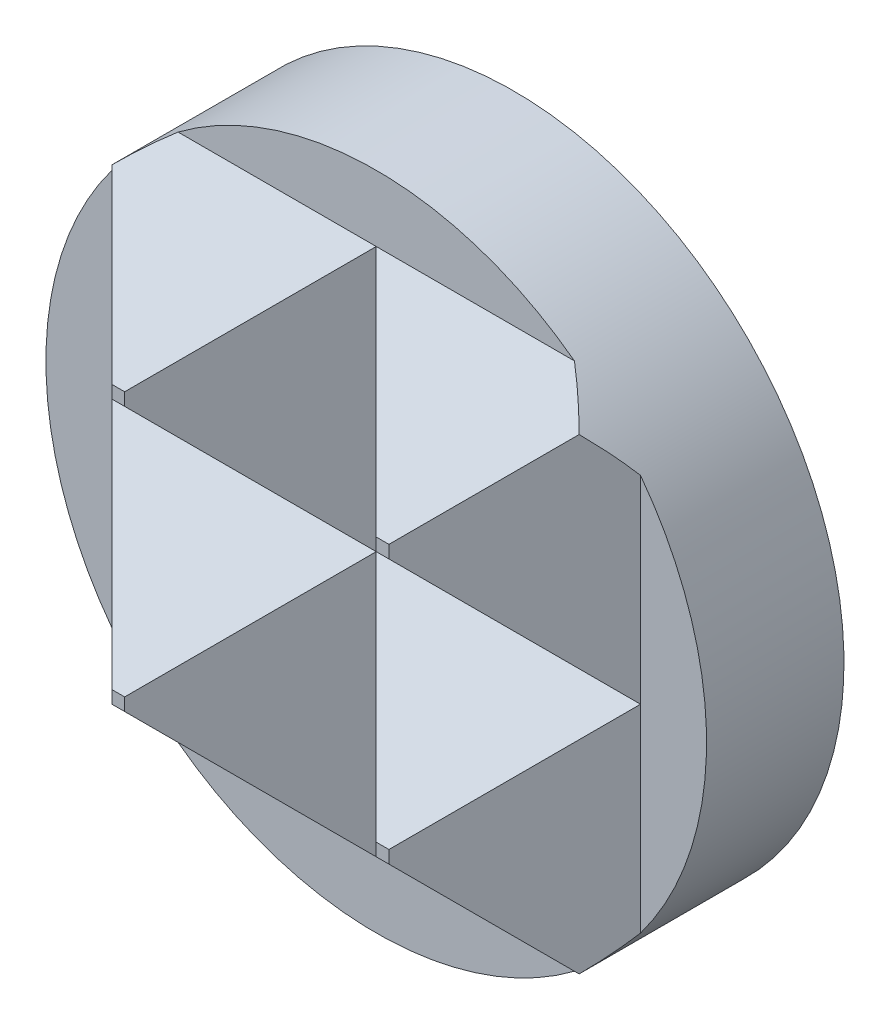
ISO-10303-21;
HEADER;
FILE_DESCRIPTION(('STEP AP214'),'2;1');
FILE_NAME('part.step','',(''),(''),'','','');
FILE_SCHEMA(('AUTOMOTIVE_DESIGN { 1 0 10303 214 1 1 1 1 }'));
ENDSEC;
DATA;
#1=APPLICATION_CONTEXT('core data for automotive mechanical design processes');
#2=APPLICATION_PROTOCOL_DEFINITION('international standard','automotive_design',2000,#1);
#3=PRODUCT_CONTEXT('',#1,'mechanical');
#4=PRODUCT('Part','Part','',(#3));
#5=PRODUCT_RELATED_PRODUCT_CATEGORY('part','',(#4));
#6=PRODUCT_DEFINITION_FORMATION('','',#4);
#7=PRODUCT_DEFINITION_CONTEXT('part definition',#1,'design');
#8=PRODUCT_DEFINITION('design','',#6,#7);
#9=PRODUCT_DEFINITION_SHAPE('','',#8);
#10=(LENGTH_UNIT() NAMED_UNIT(*) SI_UNIT(.MILLI.,.METRE.));
#11=(NAMED_UNIT(*) PLANE_ANGLE_UNIT() SI_UNIT($,.RADIAN.));
#12=(NAMED_UNIT(*) SI_UNIT($,.STERADIAN.) SOLID_ANGLE_UNIT());
#13=UNCERTAINTY_MEASURE_WITH_UNIT(LENGTH_MEASURE(1.E-05),#10,'distance_accuracy_value','');
#14=(GEOMETRIC_REPRESENTATION_CONTEXT(3) GLOBAL_UNCERTAINTY_ASSIGNED_CONTEXT((#13)) GLOBAL_UNIT_ASSIGNED_CONTEXT((#10,
#11,#12)) REPRESENTATION_CONTEXT('',''));
#15=CARTESIAN_POINT('',(0.,0.,0.));
#16=DIRECTION('',(0.,0.,1.));
#17=DIRECTION('',(1.,0.,0.));
#18=AXIS2_PLACEMENT_3D('',#15,#16,#17);
#19=CARTESIAN_POINT('',(3.96975,0.,2.159));
#20=DIRECTION('',(0.,0.707106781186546,-0.70710678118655));
#21=DIRECTION('',(0.,0.70710678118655,0.707106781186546));
#22=AXIS2_PLACEMENT_3D('',#19,#20,#21);
#23=PLANE('',#22);
#24=DIRECTION('',(-1.,0.,0.));
#25=VECTOR('',#24,1.);
#26=CARTESIAN_POINT('',(3.96975,0.,2.159));
#27=LINE('',#26,#25);
#28=CARTESIAN_POINT('',(3.175,0.,2.159));
#29=VERTEX_POINT('',#28);
#30=CARTESIAN_POINT('',(0.,0.,2.159));
#31=VERTEX_POINT('',#30);
#32=EDGE_CURVE('E18',#29,#31,#27,.T.);
#33=ORIENTED_EDGE('',*,*,#32,.F.);
#34=DIRECTION('',(-0.577350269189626,0.577350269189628,0.577350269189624));
#35=VECTOR('',#34,1.);
#36=CARTESIAN_POINT('',(3.43991666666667,-0.264916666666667,1.89408333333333));
#37=LINE('',#36,#35);
#38=CARTESIAN_POINT('',(1.6637,1.5113,3.6703));
#39=VERTEX_POINT('',#38);
#40=EDGE_CURVE('E308',#29,#39,#37,.T.);
#41=ORIENTED_EDGE('',*,*,#40,.T.);
#42=DIRECTION('',(-1.,0.,0.));
#43=VECTOR('',#42,1.);
#44=CARTESIAN_POINT('',(3.96975,1.5113,3.6703));
#45=LINE('',#44,#43);
#46=CARTESIAN_POINT('',(1.5113,1.5113,3.6703));
#47=VERTEX_POINT('',#46);
#48=EDGE_CURVE('E193',#39,#47,#45,.T.);
#49=ORIENTED_EDGE('',*,*,#48,.T.);
#50=DIRECTION('',(-0.577350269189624,-0.577350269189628,-0.577350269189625));
#51=VECTOR('',#50,1.);
#52=CARTESIAN_POINT('',(1.32325,1.32325,3.48225));
#53=LINE('',#52,#51);
#54=EDGE_CURVE('E272',#47,#31,#53,.T.);
#55=ORIENTED_EDGE('',*,*,#54,.T.);
#56=EDGE_LOOP('',(#33,#41,#49,#55));
#57=FACE_BOUND('',#56,.T.);
#58=ADVANCED_FACE('F14',(#57),#23,.F.);
#59=CARTESIAN_POINT('',(3.9698,0.,2.159));
#60=DIRECTION('',(0.,-0.707106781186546,-0.70710678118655));
#61=DIRECTION('',(0.,0.70710678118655,-0.707106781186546));
#62=AXIS2_PLACEMENT_3D('',#59,#60,#61);
#63=PLANE('',#62);
#64=DIRECTION('',(-1.,0.,0.));
#65=VECTOR('',#64,1.);
#66=CARTESIAN_POINT('',(3.9698,-1.5113,3.6703));
#67=LINE('',#66,#65);
#68=CARTESIAN_POINT('',(1.6637,-1.5113,3.6703));
#69=VERTEX_POINT('',#68);
#70=CARTESIAN_POINT('',(1.5113,-1.5113,3.6703));
#71=VERTEX_POINT('',#70);
#72=EDGE_CURVE('E181',#69,#71,#67,.T.);
#73=ORIENTED_EDGE('',*,*,#72,.F.);
#74=DIRECTION('',(0.577350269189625,0.577350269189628,-0.577350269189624));
#75=VECTOR('',#74,1.);
#76=CARTESIAN_POINT('',(3.43993333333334,0.264933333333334,1.89406666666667));
#77=LINE('',#76,#75);
#78=EDGE_CURVE('E304',#69,#29,#77,.T.);
#79=ORIENTED_EDGE('',*,*,#78,.T.);
#80=ORIENTED_EDGE('',*,*,#32,.T.);
#81=DIRECTION('',(0.577350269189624,-0.577350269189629,0.577350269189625));
#82=VECTOR('',#81,1.);
#83=CARTESIAN_POINT('',(1.32326666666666,-1.32326666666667,3.48226666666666));
#84=LINE('',#83,#82);
#85=EDGE_CURVE('E269',#31,#71,#84,.T.);
#86=ORIENTED_EDGE('',*,*,#85,.T.);
#87=EDGE_LOOP('',(#73,#79,#80,#86));
#88=FACE_BOUND('',#87,.T.);
#89=ADVANCED_FACE('F303',(#88),#63,.F.);
#90=CARTESIAN_POINT('',(3.96975,3.175,2.159));
#91=DIRECTION('',(0.,-0.707106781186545,-0.70710678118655));
#92=DIRECTION('',(0.,0.70710678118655,-0.707106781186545));
#93=AXIS2_PLACEMENT_3D('',#90,#91,#92);
#94=PLANE('',#93);
#95=DIRECTION('',(-1.,0.,0.));
#96=VECTOR('',#95,1.);
#97=CARTESIAN_POINT('',(3.96975,1.6637,3.6703));
#98=LINE('',#97,#96);
#99=CARTESIAN_POINT('',(1.6637,1.6637,3.6703));
#100=VERTEX_POINT('',#99);
#101=CARTESIAN_POINT('',(1.5113,1.6637,3.6703));
#102=VERTEX_POINT('',#101);
#103=EDGE_CURVE('E189',#100,#102,#98,.T.);
#104=ORIENTED_EDGE('',*,*,#103,.F.);
#105=DIRECTION('',(0.577350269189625,0.577350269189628,-0.577350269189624));
#106=VECTOR('',#105,1.);
#107=CARTESIAN_POINT('',(3.43991666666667,3.43991666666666,1.89408333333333));
#108=LINE('',#107,#106);
#109=CARTESIAN_POINT('',(2.80633003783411,2.80633003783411,2.52766996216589));
#110=VERTEX_POINT('',#109);
#111=EDGE_CURVE('E296',#100,#110,#108,.T.);
#112=ORIENTED_EDGE('',*,*,#111,.T.);
#113=CARTESIAN_POINT('',(0.,0.,5.334));
#114=DIRECTION('',(0.,-0.707106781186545,-0.70710678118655));
#115=DIRECTION('',(0.,-0.70710678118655,0.707106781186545));
#116=AXIS2_PLACEMENT_3D('',#113,#114,#115);
#117=ELLIPSE('',#116,5.6126600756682,3.96875);
#118=CARTESIAN_POINT('',(2.38125,3.175,2.159));
#119=VERTEX_POINT('',#118);
#120=EDGE_CURVE('E226',#119,#110,#117,.T.);
#121=ORIENTED_EDGE('',*,*,#120,.F.);
#122=DIRECTION('',(-1.,0.,0.));
#123=VECTOR('',#122,1.);
#124=CARTESIAN_POINT('',(3.96975,3.175,2.159));
#125=LINE('',#124,#123);
#126=CARTESIAN_POINT('',(0.,3.175,2.159));
#127=VERTEX_POINT('',#126);
#128=EDGE_CURVE('E197',#119,#127,#125,.T.);
#129=ORIENTED_EDGE('',*,*,#128,.T.);
#130=DIRECTION('',(0.577350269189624,-0.577350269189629,0.577350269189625));
#131=VECTOR('',#130,1.);
#132=CARTESIAN_POINT('',(1.32325,1.85175,3.48225));
#133=LINE('',#132,#131);
#134=EDGE_CURVE('E278',#127,#102,#133,.T.);
#135=ORIENTED_EDGE('',*,*,#134,.T.);
#136=EDGE_LOOP('',(#104,#112,#121,#129,#135));
#137=FACE_BOUND('',#136,.T.);
#138=ADVANCED_FACE('F280',(#137),#94,.F.);
#139=CARTESIAN_POINT('',(3.96975,1.6637,3.6703));
#140=DIRECTION('',(0.,0.,-1.));
#141=DIRECTION('',(-1.,0.,0.));
#142=AXIS2_PLACEMENT_3D('',#139,#140,#141);
#143=PLANE('',#142);
#144=ORIENTED_EDGE('',*,*,#48,.F.);
#145=DIRECTION('',(0.,1.,0.));
#146=VECTOR('',#145,1.);
#147=CARTESIAN_POINT('',(1.6637,1.6637,3.6703));
#148=LINE('',#147,#146);
#149=EDGE_CURVE('E326',#39,#100,#148,.T.);
#150=ORIENTED_EDGE('',*,*,#149,.T.);
#151=ORIENTED_EDGE('',*,*,#103,.T.);
#152=DIRECTION('',(0.,-1.,0.));
#153=VECTOR('',#152,1.);
#154=CARTESIAN_POINT('',(1.5113,1.6637,3.6703));
#155=LINE('',#154,#153);
#156=EDGE_CURVE('E275',#102,#47,#155,.T.);
#157=ORIENTED_EDGE('',*,*,#156,.T.);
#158=EDGE_LOOP('',(#144,#150,#151,#157));
#159=FACE_BOUND('',#158,.T.);
#160=ADVANCED_FACE('F344',(#159),#143,.F.);
#161=CARTESIAN_POINT('',(3.9698,-1.5113,3.6703));
#162=DIRECTION('',(0.,0.,-1.));
#163=DIRECTION('',(-1.,0.,0.));
#164=AXIS2_PLACEMENT_3D('',#161,#162,#163);
#165=PLANE('',#164);
#166=DIRECTION('',(-1.,0.,0.));
#167=VECTOR('',#166,1.);
#168=CARTESIAN_POINT('',(3.9698,-1.6637,3.6703));
#169=LINE('',#168,#167);
#170=CARTESIAN_POINT('',(1.6637,-1.6637,3.6703));
#171=VERTEX_POINT('',#170);
#172=CARTESIAN_POINT('',(1.5113,-1.6637,3.6703));
#173=VERTEX_POINT('',#172);
#174=EDGE_CURVE('E180',#171,#173,#169,.T.);
#175=ORIENTED_EDGE('',*,*,#174,.F.);
#176=DIRECTION('',(0.,1.,0.));
#177=VECTOR('',#176,1.);
#178=CARTESIAN_POINT('',(1.6637,-1.5113,3.6703));
#179=LINE('',#178,#177);
#180=EDGE_CURVE('E321',#171,#69,#179,.T.);
#181=ORIENTED_EDGE('',*,*,#180,.T.);
#182=ORIENTED_EDGE('',*,*,#72,.T.);
#183=DIRECTION('',(0.,-1.,0.));
#184=VECTOR('',#183,1.);
#185=CARTESIAN_POINT('',(1.5113,-1.5113,3.6703));
#186=LINE('',#185,#184);
#187=EDGE_CURVE('E266',#71,#173,#186,.T.);
#188=ORIENTED_EDGE('',*,*,#187,.T.);
#189=EDGE_LOOP('',(#175,#181,#182,#188));
#190=FACE_BOUND('',#189,.T.);
#191=ADVANCED_FACE('F346',(#190),#165,.F.);
#192=CARTESIAN_POINT('',(3.9698,-3.175,2.159));
#193=DIRECTION('',(0.,0.707106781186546,-0.70710678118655));
#194=DIRECTION('',(0.,0.70710678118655,0.707106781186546));
#195=AXIS2_PLACEMENT_3D('',#192,#193,#194);
#196=PLANE('',#195);
#197=CARTESIAN_POINT('',(0.,0.,5.334));
#198=DIRECTION('',(0.,0.707106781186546,-0.70710678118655));
#199=DIRECTION('',(0.,0.70710678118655,0.707106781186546));
#200=AXIS2_PLACEMENT_3D('',#197,#198,#199);
#201=ELLIPSE('',#200,5.61266007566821,3.96875);
#202=CARTESIAN_POINT('',(2.80633003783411,-2.80633003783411,2.52766996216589));
#203=VERTEX_POINT('',#202);
#204=CARTESIAN_POINT('',(2.38125,-3.175,2.159));
#205=VERTEX_POINT('',#204);
#206=EDGE_CURVE('E177',#203,#205,#201,.T.);
#207=ORIENTED_EDGE('',*,*,#206,.F.);
#208=DIRECTION('',(-0.577350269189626,0.577350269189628,0.577350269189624));
#209=VECTOR('',#208,1.);
#210=CARTESIAN_POINT('',(3.43993333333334,-3.43993333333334,1.89406666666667));
#211=LINE('',#210,#209);
#212=EDGE_CURVE('E289',#203,#171,#211,.T.);
#213=ORIENTED_EDGE('',*,*,#212,.T.);
#214=ORIENTED_EDGE('',*,*,#174,.T.);
#215=DIRECTION('',(-0.577350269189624,-0.577350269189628,-0.577350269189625));
#216=VECTOR('',#215,1.);
#217=CARTESIAN_POINT('',(1.32326666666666,-1.85173333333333,3.48226666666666));
#218=LINE('',#217,#216);
#219=CARTESIAN_POINT('',(0.,-3.175,2.159));
#220=VERTEX_POINT('',#219);
#221=EDGE_CURVE('E202',#173,#220,#218,.T.);
#222=ORIENTED_EDGE('',*,*,#221,.T.);
#223=DIRECTION('',(-1.,0.,0.));
#224=VECTOR('',#223,1.);
#225=CARTESIAN_POINT('',(3.9698,-3.175,2.159));
#226=LINE('',#225,#224);
#227=EDGE_CURVE('E186',#205,#220,#226,.T.);
#228=ORIENTED_EDGE('',*,*,#227,.F.);
#229=EDGE_LOOP('',(#207,#213,#214,#222,#228));
#230=FACE_BOUND('',#229,.T.);
#231=ADVANCED_FACE('F353',(#230),#196,.F.);
#232=CARTESIAN_POINT('',(-3.175,0.,2.159));
#233=VERTEX_POINT('',#232);
#234=EDGE_CURVE('E194',#31,#233,#27,.T.);
#235=ORIENTED_EDGE('',*,*,#234,.F.);
#236=DIRECTION('',(-0.577350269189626,0.577350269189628,0.577350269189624));
#237=VECTOR('',#236,1.);
#238=CARTESIAN_POINT('',(1.32325,-1.32325,0.83575));
#239=LINE('',#238,#237);
#240=CARTESIAN_POINT('',(-1.5113,1.5113,3.6703));
#241=VERTEX_POINT('',#240);
#242=EDGE_CURVE('E253',#31,#241,#239,.T.);
#243=ORIENTED_EDGE('',*,*,#242,.T.);
#244=CARTESIAN_POINT('',(-1.6637,1.5113,3.6703));
#245=VERTEX_POINT('',#244);
#246=EDGE_CURVE('E191',#241,#245,#45,.T.);
#247=ORIENTED_EDGE('',*,*,#246,.T.);
#248=DIRECTION('',(-0.577350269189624,-0.577350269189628,-0.577350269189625));
#249=VECTOR('',#248,1.);
#250=CARTESIAN_POINT('',(-0.793416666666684,2.38158333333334,4.54058333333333));
#251=LINE('',#250,#249);
#252=EDGE_CURVE('E159',#245,#233,#251,.T.);
#253=ORIENTED_EDGE('',*,*,#252,.T.);
#254=EDGE_LOOP('',(#235,#243,#247,#253));
#255=FACE_BOUND('',#254,.T.);
#256=ADVANCED_FACE('F250',(#255),#23,.F.);
#257=CARTESIAN_POINT('',(-1.5113,-1.5113,3.6703));
#258=VERTEX_POINT('',#257);
#259=CARTESIAN_POINT('',(-1.6637,-1.5113,3.6703));
#260=VERTEX_POINT('',#259);
#261=EDGE_CURVE('E165',#258,#260,#67,.T.);
#262=ORIENTED_EDGE('',*,*,#261,.F.);
#263=DIRECTION('',(0.577350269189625,0.577350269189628,-0.577350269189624));
#264=VECTOR('',#263,1.);
#265=CARTESIAN_POINT('',(1.32326666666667,1.32326666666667,0.835733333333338));
#266=LINE('',#265,#264);
#267=EDGE_CURVE('E257',#258,#31,#266,.T.);
#268=ORIENTED_EDGE('',*,*,#267,.T.);
#269=ORIENTED_EDGE('',*,*,#234,.T.);
#270=DIRECTION('',(0.577350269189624,-0.577350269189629,0.577350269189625));
#271=VECTOR('',#270,1.);
#272=CARTESIAN_POINT('',(-0.793400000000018,-2.3816,4.5406));
#273=LINE('',#272,#271);
#274=EDGE_CURVE('E148',#233,#260,#273,.T.);
#275=ORIENTED_EDGE('',*,*,#274,.T.);
#276=EDGE_LOOP('',(#262,#268,#269,#275));
#277=FACE_BOUND('',#276,.T.);
#278=ADVANCED_FACE('F312',(#277),#63,.F.);
#279=CARTESIAN_POINT('',(0.,0.,2.159));
#280=DIRECTION('',(0.,0.,1.));
#281=DIRECTION('',(1.,0.,0.));
#282=AXIS2_PLACEMENT_3D('',#279,#280,#281);
#283=PLANE('',#282);
#284=CARTESIAN_POINT('',(0.,0.,2.159));
#285=DIRECTION('',(0.,0.,1.));
#286=DIRECTION('',(1.,0.,0.));
#287=AXIS2_PLACEMENT_3D('',#284,#285,#286);
#288=CIRCLE('',#287,3.96875);
#289=CARTESIAN_POINT('',(-2.38125,-3.175,2.159));
#290=VERTEX_POINT('',#289);
#291=EDGE_CURVE('E220',#290,#205,#288,.T.);
#292=ORIENTED_EDGE('',*,*,#291,.T.);
#293=ORIENTED_EDGE('',*,*,#227,.T.);
#294=EDGE_CURVE('E183',#220,#290,#226,.T.);
#295=ORIENTED_EDGE('',*,*,#294,.T.);
#296=EDGE_LOOP('',(#292,#293,#295));
#297=FACE_BOUND('',#296,.T.);
#298=ADVANCED_FACE('F369',(#297),#283,.T.);
#299=CARTESIAN_POINT('',(0.,0.,0.));
#300=DIRECTION('',(0.,0.,1.));
#301=DIRECTION('',(1.,0.,0.));
#302=AXIS2_PLACEMENT_3D('',#299,#300,#301);
#303=CYLINDRICAL_SURFACE('',#302,3.96875);
#304=CARTESIAN_POINT('',(0.,0.,5.334));
#305=DIRECTION('',(0.707106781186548,0.,-0.707106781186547));
#306=DIRECTION('',(0.707106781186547,0.,0.707106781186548));
#307=AXIS2_PLACEMENT_3D('',#304,#305,#306);
#308=ELLIPSE('',#307,5.61266007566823,3.96875);
#309=CARTESIAN_POINT('',(-3.175,-2.38125,2.159));
#310=VERTEX_POINT('',#309);
#311=CARTESIAN_POINT('',(-2.80633003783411,-2.80633003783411,2.52766996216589));
#312=VERTEX_POINT('',#311);
#313=EDGE_CURVE('E39',#310,#312,#308,.F.);
#314=ORIENTED_EDGE('',*,*,#313,.F.);
#315=CARTESIAN_POINT('',(0.,0.,2.159));
#316=DIRECTION('',(0.,0.,-1.));
#317=DIRECTION('',(-1.,0.,0.));
#318=AXIS2_PLACEMENT_3D('',#315,#316,#317);
#319=CIRCLE('',#318,3.96875);
#320=CARTESIAN_POINT('',(-3.175,2.38125,2.159));
#321=VERTEX_POINT('',#320);
#322=EDGE_CURVE('E133',#321,#310,#319,.F.);
#323=ORIENTED_EDGE('',*,*,#322,.F.);
#324=CARTESIAN_POINT('',(-2.80633003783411,2.80633003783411,2.52766996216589));
#325=VERTEX_POINT('',#324);
#326=EDGE_CURVE('E158',#325,#321,#308,.F.);
#327=ORIENTED_EDGE('',*,*,#326,.F.);
#328=CARTESIAN_POINT('',(0.,0.,5.334));
#329=DIRECTION('',(0.,0.707106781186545,0.70710678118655));
#330=DIRECTION('',(0.,-0.70710678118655,0.707106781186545));
#331=AXIS2_PLACEMENT_3D('',#328,#329,#330);
#332=ELLIPSE('',#331,5.6126600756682,3.96875);
#333=CARTESIAN_POINT('',(-2.38125,3.175,2.159));
#334=VERTEX_POINT('',#333);
#335=EDGE_CURVE('E179',#334,#325,#332,.T.);
#336=ORIENTED_EDGE('',*,*,#335,.F.);
#337=EDGE_CURVE('E224',#119,#334,#288,.T.);
#338=ORIENTED_EDGE('',*,*,#337,.F.);
#339=ORIENTED_EDGE('',*,*,#120,.T.);
#340=CARTESIAN_POINT('',(0.,0.,5.334));
#341=DIRECTION('',(-0.707106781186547,0.,-0.707106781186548));
#342=DIRECTION('',(-0.707106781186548,0.,0.707106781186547));
#343=AXIS2_PLACEMENT_3D('',#340,#341,#342);
#344=ELLIPSE('',#343,5.61266007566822,3.96875);
#345=CARTESIAN_POINT('',(3.175,2.38125,2.159));
#346=VERTEX_POINT('',#345);
#347=EDGE_CURVE('E24',#346,#110,#344,.F.);
#348=ORIENTED_EDGE('',*,*,#347,.F.);
#349=CARTESIAN_POINT('',(0.,0.,2.159));
#350=DIRECTION('',(0.,0.,-1.));
#351=DIRECTION('',(-1.,0.,0.));
#352=AXIS2_PLACEMENT_3D('',#349,#350,#351);
#353=CIRCLE('',#352,3.96875);
#354=CARTESIAN_POINT('',(3.175,-2.38125,2.159));
#355=VERTEX_POINT('',#354);
#356=EDGE_CURVE('E142',#355,#346,#353,.F.);
#357=ORIENTED_EDGE('',*,*,#356,.F.);
#358=EDGE_CURVE('E9',#203,#355,#344,.F.);
#359=ORIENTED_EDGE('',*,*,#358,.F.);
#360=ORIENTED_EDGE('',*,*,#206,.T.);
#361=ORIENTED_EDGE('',*,*,#291,.F.);
#362=CARTESIAN_POINT('',(0.,0.,5.334));
#363=DIRECTION('',(0.,-0.707106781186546,0.70710678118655));
#364=DIRECTION('',(0.,0.70710678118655,0.707106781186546));
#365=AXIS2_PLACEMENT_3D('',#362,#363,#364);
#366=ELLIPSE('',#365,5.61266007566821,3.96875);
#367=EDGE_CURVE('E156',#312,#290,#366,.T.);
#368=ORIENTED_EDGE('',*,*,#367,.F.);
#369=EDGE_LOOP('',(#314,#323,#327,#336,#338,#339,#348,#357,#359,#360,#361,#368));
#370=FACE_BOUND('',#369,.T.);
#371=CARTESIAN_POINT('',(0.,0.,0.508));
#372=DIRECTION('',(0.,0.,-1.));
#373=DIRECTION('',(-1.,0.,0.));
#374=AXIS2_PLACEMENT_3D('',#371,#372,#373);
#375=CIRCLE('',#374,3.96875);
#376=CARTESIAN_POINT('',(-3.96875,0.,0.508));
#377=VERTEX_POINT('',#376);
#378=EDGE_CURVE('E225',#377,#377,#375,.T.);
#379=ORIENTED_EDGE('',*,*,#378,.F.);
#380=EDGE_LOOP('',(#379));
#381=FACE_BOUND('',#380,.T.);
#382=ADVANCED_FACE('F16',(#370,#381),#303,.T.);
#383=ORIENTED_EDGE('',*,*,#337,.T.);
#384=EDGE_CURVE('E231',#127,#334,#125,.T.);
#385=ORIENTED_EDGE('',*,*,#384,.F.);
#386=ORIENTED_EDGE('',*,*,#128,.F.);
#387=EDGE_LOOP('',(#383,#385,#386));
#388=FACE_BOUND('',#387,.T.);
#389=ADVANCED_FACE('F293',(#388),#283,.T.);
#390=CARTESIAN_POINT('',(0.,0.,0.508));
#391=DIRECTION('',(0.,0.,-1.));
#392=DIRECTION('',(-1.,0.,0.));
#393=AXIS2_PLACEMENT_3D('',#390,#391,#392);
#394=PLANE('',#393);
#395=CARTESIAN_POINT('',(0.,0.,0.508));
#396=DIRECTION('',(0.,0.,-1.));
#397=DIRECTION('',(-1.,0.,0.));
#398=AXIS2_PLACEMENT_3D('',#395,#396,#397);
#399=CIRCLE('',#398,3.71475);
#400=CARTESIAN_POINT('',(-3.71475,0.,0.508));
#401=VERTEX_POINT('',#400);
#402=EDGE_CURVE('E297',#401,#401,#399,.T.);
#403=ORIENTED_EDGE('',*,*,#402,.F.);
#404=EDGE_LOOP('',(#403));
#405=FACE_BOUND('',#404,.T.);
#406=ORIENTED_EDGE('',*,*,#378,.T.);
#407=EDGE_LOOP('',(#406));
#408=FACE_BOUND('',#407,.T.);
#409=ADVANCED_FACE('F504',(#405,#408),#394,.T.);
#410=CARTESIAN_POINT('',(0.,0.,0.));
#411=DIRECTION('',(0.,0.,1.));
#412=DIRECTION('',(1.,0.,0.));
#413=AXIS2_PLACEMENT_3D('',#410,#411,#412);
#414=PLANE('',#413);
#415=CARTESIAN_POINT('',(0.,0.,0.));
#416=DIRECTION('',(0.,0.,1.));
#417=DIRECTION('',(1.,0.,0.));
#418=AXIS2_PLACEMENT_3D('',#415,#416,#417);
#419=CIRCLE('',#418,3.20675);
#420=CARTESIAN_POINT('',(3.20675,0.,0.));
#421=VERTEX_POINT('',#420);
#422=EDGE_CURVE('E217',#421,#421,#419,.F.);
#423=ORIENTED_EDGE('',*,*,#422,.T.);
#424=EDGE_LOOP('',(#423));
#425=FACE_BOUND('',#424,.T.);
#426=ADVANCED_FACE('F495',(#425),#414,.F.);
#427=CARTESIAN_POINT('',(0.,0.,0.));
#428=DIRECTION('',(0.,0.,1.));
#429=DIRECTION('',(1.,0.,0.));
#430=AXIS2_PLACEMENT_3D('',#427,#428,#429);
#431=CONICAL_SURFACE('',#430,3.20675,0.785398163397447);
#432=ORIENTED_EDGE('',*,*,#402,.T.);
#433=EDGE_LOOP('',(#432));
#434=FACE_BOUND('',#433,.T.);
#435=ORIENTED_EDGE('',*,*,#422,.F.);
#436=EDGE_LOOP('',(#435));
#437=FACE_BOUND('',#436,.T.);
#438=ADVANCED_FACE('F488',(#434,#437),#431,.T.);
#439=CARTESIAN_POINT('',(-1.5113,1.6637,3.6703));
#440=VERTEX_POINT('',#439);
#441=CARTESIAN_POINT('',(-1.6637,1.6637,3.6703));
#442=VERTEX_POINT('',#441);
#443=EDGE_CURVE('E192',#440,#442,#98,.T.);
#444=ORIENTED_EDGE('',*,*,#443,.F.);
#445=DIRECTION('',(0.577350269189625,0.577350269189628,-0.577350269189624));
#446=VECTOR('',#445,1.);
#447=CARTESIAN_POINT('',(1.32325,4.49825,0.83575));
#448=LINE('',#447,#446);
#449=EDGE_CURVE('E259',#440,#127,#448,.T.);
#450=ORIENTED_EDGE('',*,*,#449,.T.);
#451=ORIENTED_EDGE('',*,*,#384,.T.);
#452=ORIENTED_EDGE('',*,*,#335,.T.);
#453=DIRECTION('',(0.577350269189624,-0.577350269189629,0.577350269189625));
#454=VECTOR('',#453,1.);
#455=CARTESIAN_POINT('',(-0.793416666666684,0.793416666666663,4.54058333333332));
#456=LINE('',#455,#454);
#457=EDGE_CURVE('E163',#325,#442,#456,.T.);
#458=ORIENTED_EDGE('',*,*,#457,.T.);
#459=EDGE_LOOP('',(#444,#450,#451,#452,#458));
#460=FACE_BOUND('',#459,.T.);
#461=ADVANCED_FACE('F291',(#460),#94,.F.);
#462=ORIENTED_EDGE('',*,*,#246,.F.);
#463=DIRECTION('',(0.,1.,0.));
#464=VECTOR('',#463,1.);
#465=CARTESIAN_POINT('',(-1.5113,1.6637,3.6703));
#466=LINE('',#465,#464);
#467=EDGE_CURVE('E245',#241,#440,#466,.T.);
#468=ORIENTED_EDGE('',*,*,#467,.T.);
#469=ORIENTED_EDGE('',*,*,#443,.T.);
#470=DIRECTION('',(0.,-1.,0.));
#471=VECTOR('',#470,1.);
#472=CARTESIAN_POINT('',(-1.6637,1.6637,3.6703));
#473=LINE('',#472,#471);
#474=EDGE_CURVE('E168',#442,#245,#473,.T.);
#475=ORIENTED_EDGE('',*,*,#474,.T.);
#476=EDGE_LOOP('',(#462,#468,#469,#475));
#477=FACE_BOUND('',#476,.T.);
#478=ADVANCED_FACE('F244',(#477),#143,.F.);
#479=CARTESIAN_POINT('',(-1.5113,-1.6637,3.6703));
#480=VERTEX_POINT('',#479);
#481=CARTESIAN_POINT('',(-1.6637,-1.6637,3.6703));
#482=VERTEX_POINT('',#481);
#483=EDGE_CURVE('E185',#480,#482,#169,.T.);
#484=ORIENTED_EDGE('',*,*,#483,.F.);
#485=DIRECTION('',(0.,1.,0.));
#486=VECTOR('',#485,1.);
#487=CARTESIAN_POINT('',(-1.5113,-1.5113,3.6703));
#488=LINE('',#487,#486);
#489=EDGE_CURVE('E31',#480,#258,#488,.T.);
#490=ORIENTED_EDGE('',*,*,#489,.T.);
#491=ORIENTED_EDGE('',*,*,#261,.T.);
#492=DIRECTION('',(0.,-1.,0.));
#493=VECTOR('',#492,1.);
#494=CARTESIAN_POINT('',(-1.6637,-1.5113,3.6703));
#495=LINE('',#494,#493);
#496=EDGE_CURVE('E150',#260,#482,#495,.T.);
#497=ORIENTED_EDGE('',*,*,#496,.T.);
#498=EDGE_LOOP('',(#484,#490,#491,#497));
#499=FACE_BOUND('',#498,.T.);
#500=ADVANCED_FACE('F317',(#499),#165,.F.);
#501=ORIENTED_EDGE('',*,*,#294,.F.);
#502=DIRECTION('',(-0.577350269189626,0.577350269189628,0.577350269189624));
#503=VECTOR('',#502,1.);
#504=CARTESIAN_POINT('',(1.32326666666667,-4.49826666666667,0.835733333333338));
#505=LINE('',#504,#503);
#506=EDGE_CURVE('E209',#220,#480,#505,.T.);
#507=ORIENTED_EDGE('',*,*,#506,.T.);
#508=ORIENTED_EDGE('',*,*,#483,.T.);
#509=DIRECTION('',(-0.577350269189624,-0.577350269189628,-0.577350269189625));
#510=VECTOR('',#509,1.);
#511=CARTESIAN_POINT('',(-0.793400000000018,-0.7934,4.5406));
#512=LINE('',#511,#510);
#513=EDGE_CURVE('E214',#482,#312,#512,.T.);
#514=ORIENTED_EDGE('',*,*,#513,.T.);
#515=ORIENTED_EDGE('',*,*,#367,.T.);
#516=EDGE_LOOP('',(#501,#507,#508,#514,#515));
#517=FACE_BOUND('',#516,.T.);
#518=ADVANCED_FACE('F371',(#517),#196,.F.);
#519=CARTESIAN_POINT('',(-3.175,-3.96875,2.159));
#520=DIRECTION('',(0.707106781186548,0.,-0.707106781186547));
#521=DIRECTION('',(-0.707106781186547,0.,-0.707106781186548));
#522=AXIS2_PLACEMENT_3D('',#519,#520,#521);
#523=PLANE('',#522);
#524=DIRECTION('',(0.,1.,0.));
#525=VECTOR('',#524,1.);
#526=CARTESIAN_POINT('',(-3.175,-3.96875,2.159));
#527=LINE('',#526,#525);
#528=EDGE_CURVE('E135',#310,#233,#527,.T.);
#529=ORIENTED_EDGE('',*,*,#528,.F.);
#530=ORIENTED_EDGE('',*,*,#313,.T.);
#531=ORIENTED_EDGE('',*,*,#513,.F.);
#532=ORIENTED_EDGE('',*,*,#496,.F.);
#533=ORIENTED_EDGE('',*,*,#274,.F.);
#534=EDGE_LOOP('',(#529,#530,#531,#532,#533));
#535=FACE_BOUND('',#534,.T.);
#536=ADVANCED_FACE('F145',(#535),#523,.F.);
#537=ORIENTED_EDGE('',*,*,#326,.T.);
#538=EDGE_CURVE('E138',#233,#321,#527,.T.);
#539=ORIENTED_EDGE('',*,*,#538,.F.);
#540=ORIENTED_EDGE('',*,*,#252,.F.);
#541=ORIENTED_EDGE('',*,*,#474,.F.);
#542=ORIENTED_EDGE('',*,*,#457,.F.);
#543=EDGE_LOOP('',(#537,#539,#540,#541,#542));
#544=FACE_BOUND('',#543,.T.);
#545=ADVANCED_FACE('F247',(#544),#523,.F.);
#546=CARTESIAN_POINT('',(0.,-3.96875,2.159));
#547=DIRECTION('',(-0.707106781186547,0.,-0.707106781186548));
#548=DIRECTION('',(-0.707106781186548,0.,0.707106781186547));
#549=AXIS2_PLACEMENT_3D('',#546,#547,#548);
#550=PLANE('',#549);
#551=ORIENTED_EDGE('',*,*,#489,.F.);
#552=ORIENTED_EDGE('',*,*,#506,.F.);
#553=DIRECTION('',(0.,1.,0.));
#554=VECTOR('',#553,1.);
#555=CARTESIAN_POINT('',(0.,-3.96875,2.159));
#556=LINE('',#555,#554);
#557=EDGE_CURVE('E288',#220,#31,#556,.T.);
#558=ORIENTED_EDGE('',*,*,#557,.T.);
#559=ORIENTED_EDGE('',*,*,#267,.F.);
#560=EDGE_LOOP('',(#551,#552,#558,#559));
#561=FACE_BOUND('',#560,.T.);
#562=ADVANCED_FACE('F314',(#561),#550,.F.);
#563=CARTESIAN_POINT('',(0.,-3.96875,2.159));
#564=DIRECTION('',(0.707106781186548,0.,-0.707106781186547));
#565=DIRECTION('',(-0.707106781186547,0.,-0.707106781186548));
#566=AXIS2_PLACEMENT_3D('',#563,#564,#565);
#567=PLANE('',#566);
#568=ORIENTED_EDGE('',*,*,#557,.F.);
#569=ORIENTED_EDGE('',*,*,#221,.F.);
#570=ORIENTED_EDGE('',*,*,#187,.F.);
#571=ORIENTED_EDGE('',*,*,#85,.F.);
#572=EDGE_LOOP('',(#568,#569,#570,#571));
#573=FACE_BOUND('',#572,.T.);
#574=ADVANCED_FACE('F387',(#573),#567,.F.);
#575=EDGE_CURVE('E286',#31,#127,#556,.T.);
#576=ORIENTED_EDGE('',*,*,#575,.F.);
#577=ORIENTED_EDGE('',*,*,#54,.F.);
#578=ORIENTED_EDGE('',*,*,#156,.F.);
#579=ORIENTED_EDGE('',*,*,#134,.F.);
#580=EDGE_LOOP('',(#576,#577,#578,#579));
#581=FACE_BOUND('',#580,.T.);
#582=ADVANCED_FACE('F284',(#581),#567,.F.);
#583=ORIENTED_EDGE('',*,*,#467,.F.);
#584=ORIENTED_EDGE('',*,*,#242,.F.);
#585=ORIENTED_EDGE('',*,*,#575,.T.);
#586=ORIENTED_EDGE('',*,*,#449,.F.);
#587=EDGE_LOOP('',(#583,#584,#585,#586));
#588=FACE_BOUND('',#587,.T.);
#589=ADVANCED_FACE('F287',(#588),#550,.F.);
#590=CARTESIAN_POINT('',(3.175,-3.96875,2.159));
#591=DIRECTION('',(-0.707106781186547,0.,-0.707106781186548));
#592=DIRECTION('',(-0.707106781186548,0.,0.707106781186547));
#593=AXIS2_PLACEMENT_3D('',#590,#591,#592);
#594=PLANE('',#593);
#595=DIRECTION('',(0.,1.,0.));
#596=VECTOR('',#595,1.);
#597=CARTESIAN_POINT('',(3.175,-3.96875,2.159));
#598=LINE('',#597,#596);
#599=EDGE_CURVE('E331',#29,#346,#598,.T.);
#600=ORIENTED_EDGE('',*,*,#599,.T.);
#601=ORIENTED_EDGE('',*,*,#347,.T.);
#602=ORIENTED_EDGE('',*,*,#111,.F.);
#603=ORIENTED_EDGE('',*,*,#149,.F.);
#604=ORIENTED_EDGE('',*,*,#40,.F.);
#605=EDGE_LOOP('',(#600,#601,#602,#603,#604));
#606=FACE_BOUND('',#605,.T.);
#607=ADVANCED_FACE('F342',(#606),#594,.F.);
#608=ORIENTED_EDGE('',*,*,#358,.T.);
#609=EDGE_CURVE('E330',#355,#29,#598,.T.);
#610=ORIENTED_EDGE('',*,*,#609,.T.);
#611=ORIENTED_EDGE('',*,*,#78,.F.);
#612=ORIENTED_EDGE('',*,*,#180,.F.);
#613=ORIENTED_EDGE('',*,*,#212,.F.);
#614=EDGE_LOOP('',(#608,#610,#611,#612,#613));
#615=FACE_BOUND('',#614,.T.);
#616=ADVANCED_FACE('F384',(#615),#594,.F.);
#617=CARTESIAN_POINT('',(7.112,-3.96875,2.159));
#618=DIRECTION('',(0.,0.,-1.));
#619=DIRECTION('',(-1.,0.,0.));
#620=AXIS2_PLACEMENT_3D('',#617,#618,#619);
#621=PLANE('',#620);
#622=ORIENTED_EDGE('',*,*,#609,.F.);
#623=ORIENTED_EDGE('',*,*,#356,.T.);
#624=ORIENTED_EDGE('',*,*,#599,.F.);
#625=EDGE_LOOP('',(#622,#623,#624));
#626=FACE_BOUND('',#625,.T.);
#627=ADVANCED_FACE('F339',(#626),#621,.F.);
#628=CARTESIAN_POINT('',(-7.112,-3.96875,2.159));
#629=DIRECTION('',(0.,0.,-1.));
#630=DIRECTION('',(-1.,0.,0.));
#631=AXIS2_PLACEMENT_3D('',#628,#629,#630);
#632=PLANE('',#631);
#633=ORIENTED_EDGE('',*,*,#322,.T.);
#634=ORIENTED_EDGE('',*,*,#528,.T.);
#635=ORIENTED_EDGE('',*,*,#538,.T.);
#636=EDGE_LOOP('',(#633,#634,#635));
#637=FACE_BOUND('',#636,.T.);
#638=ADVANCED_FACE('F134',(#637),#632,.F.);
#639=CLOSED_SHELL('',(#58,#89,#138,#160,#191,#231,#256,#278,#298,#382,#389,#409,#426,#438,#461,
#478,#500,#518,#536,#545,#562,#574,#582,#589,#607,#616,#627,#638));
#640=MANIFOLD_SOLID_BREP('B1',#639);
#641=ADVANCED_BREP_SHAPE_REPRESENTATION('',(#18,#640),#14);
#642=SHAPE_DEFINITION_REPRESENTATION(#9,#641);
ENDSEC;
END-ISO-10303-21;
